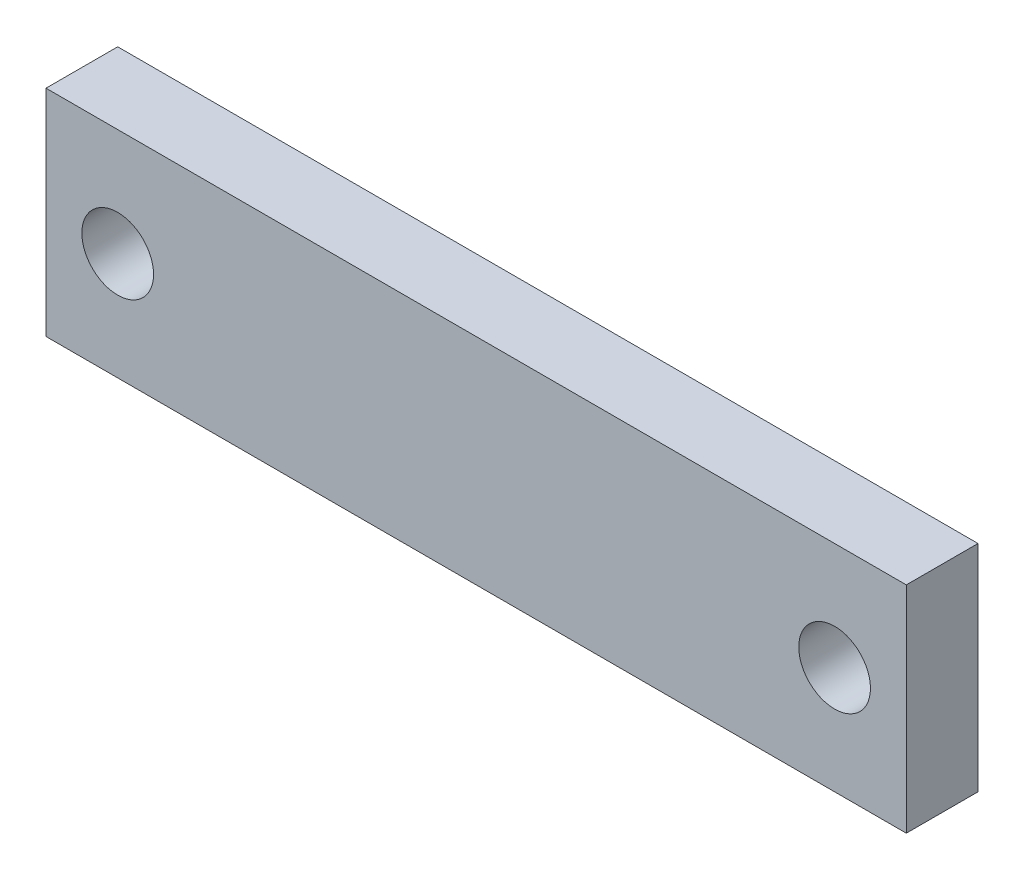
ISO-10303-21;
HEADER;
FILE_DESCRIPTION(('STEP AP214'),'2;1');
FILE_NAME('part.step','',(''),(''),'','','');
FILE_SCHEMA(('AUTOMOTIVE_DESIGN { 1 0 10303 214 1 1 1 1 }'));
ENDSEC;
DATA;
#1=APPLICATION_CONTEXT('core data for automotive mechanical design processes');
#2=APPLICATION_PROTOCOL_DEFINITION('international standard','automotive_design',2000,#1);
#3=PRODUCT_CONTEXT('',#1,'mechanical');
#4=PRODUCT('Part','Part','',(#3));
#5=PRODUCT_RELATED_PRODUCT_CATEGORY('part','',(#4));
#6=PRODUCT_DEFINITION_FORMATION('','',#4);
#7=PRODUCT_DEFINITION_CONTEXT('part definition',#1,'design');
#8=PRODUCT_DEFINITION('design','',#6,#7);
#9=PRODUCT_DEFINITION_SHAPE('','',#8);
#10=(LENGTH_UNIT() NAMED_UNIT(*) SI_UNIT(.MILLI.,.METRE.));
#11=(NAMED_UNIT(*) PLANE_ANGLE_UNIT() SI_UNIT($,.RADIAN.));
#12=(NAMED_UNIT(*) SI_UNIT($,.STERADIAN.) SOLID_ANGLE_UNIT());
#13=UNCERTAINTY_MEASURE_WITH_UNIT(LENGTH_MEASURE(1.E-05),#10,'distance_accuracy_value','');
#14=(GEOMETRIC_REPRESENTATION_CONTEXT(3) GLOBAL_UNCERTAINTY_ASSIGNED_CONTEXT((#13)) GLOBAL_UNIT_ASSIGNED_CONTEXT((#10,
#11,#12)) REPRESENTATION_CONTEXT('',''));
#15=CARTESIAN_POINT('',(0.,0.,0.));
#16=DIRECTION('',(0.,0.,1.));
#17=DIRECTION('',(1.,0.,0.));
#18=AXIS2_PLACEMENT_3D('',#15,#16,#17);
#19=CARTESIAN_POINT('',(-100.,0.,10.));
#20=DIRECTION('',(0.,0.,1.));
#21=DIRECTION('',(1.,0.,0.));
#22=AXIS2_PLACEMENT_3D('',#19,#20,#21);
#23=PLANE('',#22);
#24=CARTESIAN_POINT('',(-90.,15.,10.));
#25=DIRECTION('',(0.,0.,1.));
#26=DIRECTION('',(1.,0.,0.));
#27=AXIS2_PLACEMENT_3D('',#24,#25,#26);
#28=CIRCLE('',#27,5.);
#29=CARTESIAN_POINT('',(-85.,15.,10.));
#30=VERTEX_POINT('',#29);
#31=EDGE_CURVE('E97',#30,#30,#28,.T.);
#32=ORIENTED_EDGE('',*,*,#31,.F.);
#33=EDGE_LOOP('',(#32));
#34=FACE_BOUND('',#33,.T.);
#35=DIRECTION('',(0.,-1.,0.));
#36=VECTOR('',#35,1.);
#37=CARTESIAN_POINT('',(-100.,30.,10.));
#38=LINE('',#37,#36);
#39=CARTESIAN_POINT('',(-100.,30.,10.));
#40=VERTEX_POINT('',#39);
#41=CARTESIAN_POINT('',(-100.,0.,10.));
#42=VERTEX_POINT('',#41);
#43=EDGE_CURVE('E82',#40,#42,#38,.T.);
#44=ORIENTED_EDGE('',*,*,#43,.T.);
#45=DIRECTION('',(1.,0.,0.));
#46=VECTOR('',#45,1.);
#47=CARTESIAN_POINT('',(-100.,0.,10.));
#48=LINE('',#47,#46);
#49=CARTESIAN_POINT('',(20.,0.,10.));
#50=VERTEX_POINT('',#49);
#51=EDGE_CURVE('E77',#42,#50,#48,.T.);
#52=ORIENTED_EDGE('',*,*,#51,.T.);
#53=DIRECTION('',(0.,1.,0.));
#54=VECTOR('',#53,1.);
#55=CARTESIAN_POINT('',(20.,30.,10.));
#56=LINE('',#55,#54);
#57=CARTESIAN_POINT('',(20.,30.,10.));
#58=VERTEX_POINT('',#57);
#59=EDGE_CURVE('E80',#50,#58,#56,.T.);
#60=ORIENTED_EDGE('',*,*,#59,.T.);
#61=DIRECTION('',(-1.,0.,0.));
#62=VECTOR('',#61,1.);
#63=CARTESIAN_POINT('',(-100.,30.,10.));
#64=LINE('',#63,#62);
#65=EDGE_CURVE('E47',#58,#40,#64,.T.);
#66=ORIENTED_EDGE('',*,*,#65,.T.);
#67=EDGE_LOOP('',(#44,#52,#60,#66));
#68=FACE_BOUND('',#67,.T.);
#69=CARTESIAN_POINT('',(10.,15.,10.));
#70=DIRECTION('',(0.,0.,1.));
#71=DIRECTION('',(1.,0.,0.));
#72=AXIS2_PLACEMENT_3D('',#69,#70,#71);
#73=CIRCLE('',#72,4.99999999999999);
#74=CARTESIAN_POINT('',(15.,15.,10.));
#75=VERTEX_POINT('',#74);
#76=EDGE_CURVE('E112',#75,#75,#73,.T.);
#77=ORIENTED_EDGE('',*,*,#76,.F.);
#78=EDGE_LOOP('',(#77));
#79=FACE_BOUND('',#78,.T.);
#80=ADVANCED_FACE('F30',(#34,#68,#79),#23,.T.);
#81=CARTESIAN_POINT('',(-100.,0.,0.));
#82=DIRECTION('',(0.,0.,1.));
#83=DIRECTION('',(1.,0.,0.));
#84=AXIS2_PLACEMENT_3D('',#81,#82,#83);
#85=PLANE('',#84);
#86=CARTESIAN_POINT('',(-90.,15.,0.));
#87=DIRECTION('',(0.,0.,1.));
#88=DIRECTION('',(1.,0.,0.));
#89=AXIS2_PLACEMENT_3D('',#86,#87,#88);
#90=CIRCLE('',#89,5.);
#91=CARTESIAN_POINT('',(-85.,15.,0.));
#92=VERTEX_POINT('',#91);
#93=EDGE_CURVE('E109',#92,#92,#90,.T.);
#94=ORIENTED_EDGE('',*,*,#93,.T.);
#95=EDGE_LOOP('',(#94));
#96=FACE_BOUND('',#95,.T.);
#97=DIRECTION('',(0.,-1.,0.));
#98=VECTOR('',#97,1.);
#99=CARTESIAN_POINT('',(-100.,30.,0.));
#100=LINE('',#99,#98);
#101=CARTESIAN_POINT('',(-100.,30.,0.));
#102=VERTEX_POINT('',#101);
#103=CARTESIAN_POINT('',(-100.,0.,0.));
#104=VERTEX_POINT('',#103);
#105=EDGE_CURVE('E94',#102,#104,#100,.T.);
#106=ORIENTED_EDGE('',*,*,#105,.F.);
#107=DIRECTION('',(-1.,0.,0.));
#108=VECTOR('',#107,1.);
#109=CARTESIAN_POINT('',(-100.,30.,0.));
#110=LINE('',#109,#108);
#111=CARTESIAN_POINT('',(20.,30.,0.));
#112=VERTEX_POINT('',#111);
#113=EDGE_CURVE('E70',#112,#102,#110,.T.);
#114=ORIENTED_EDGE('',*,*,#113,.F.);
#115=DIRECTION('',(0.,1.,0.));
#116=VECTOR('',#115,1.);
#117=CARTESIAN_POINT('',(20.,30.,0.));
#118=LINE('',#117,#116);
#119=CARTESIAN_POINT('',(20.,0.,0.));
#120=VERTEX_POINT('',#119);
#121=EDGE_CURVE('E64',#120,#112,#118,.T.);
#122=ORIENTED_EDGE('',*,*,#121,.F.);
#123=DIRECTION('',(1.,0.,0.));
#124=VECTOR('',#123,1.);
#125=CARTESIAN_POINT('',(-100.,0.,0.));
#126=LINE('',#125,#124);
#127=EDGE_CURVE('E86',#104,#120,#126,.T.);
#128=ORIENTED_EDGE('',*,*,#127,.F.);
#129=EDGE_LOOP('',(#106,#114,#122,#128));
#130=FACE_BOUND('',#129,.T.);
#131=CARTESIAN_POINT('',(10.,15.,0.));
#132=DIRECTION('',(0.,0.,1.));
#133=DIRECTION('',(1.,0.,0.));
#134=AXIS2_PLACEMENT_3D('',#131,#132,#133);
#135=CIRCLE('',#134,4.99999999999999);
#136=CARTESIAN_POINT('',(15.,15.,0.));
#137=VERTEX_POINT('',#136);
#138=EDGE_CURVE('E115',#137,#137,#135,.T.);
#139=ORIENTED_EDGE('',*,*,#138,.T.);
#140=EDGE_LOOP('',(#139));
#141=FACE_BOUND('',#140,.T.);
#142=ADVANCED_FACE('F105',(#96,#130,#141),#85,.F.);
#143=CARTESIAN_POINT('',(-100.,30.,10.));
#144=DIRECTION('',(1.,0.,0.));
#145=DIRECTION('',(0.,0.,-1.));
#146=AXIS2_PLACEMENT_3D('',#143,#144,#145);
#147=PLANE('',#146);
#148=ORIENTED_EDGE('',*,*,#105,.T.);
#149=DIRECTION('',(0.,0.,-1.));
#150=VECTOR('',#149,1.);
#151=CARTESIAN_POINT('',(-100.,0.,10.));
#152=LINE('',#151,#150);
#153=EDGE_CURVE('E11',#42,#104,#152,.T.);
#154=ORIENTED_EDGE('',*,*,#153,.F.);
#155=ORIENTED_EDGE('',*,*,#43,.F.);
#156=DIRECTION('',(0.,0.,-1.));
#157=VECTOR('',#156,1.);
#158=CARTESIAN_POINT('',(-100.,30.,10.));
#159=LINE('',#158,#157);
#160=EDGE_CURVE('E90',#40,#102,#159,.T.);
#161=ORIENTED_EDGE('',*,*,#160,.T.);
#162=EDGE_LOOP('',(#148,#154,#155,#161));
#163=FACE_BOUND('',#162,.T.);
#164=ADVANCED_FACE('F32',(#163),#147,.F.);
#165=CARTESIAN_POINT('',(-100.,0.,10.));
#166=DIRECTION('',(0.,1.,0.));
#167=DIRECTION('',(0.,0.,1.));
#168=AXIS2_PLACEMENT_3D('',#165,#166,#167);
#169=PLANE('',#168);
#170=ORIENTED_EDGE('',*,*,#127,.T.);
#171=DIRECTION('',(0.,0.,-1.));
#172=VECTOR('',#171,1.);
#173=CARTESIAN_POINT('',(20.,0.,10.));
#174=LINE('',#173,#172);
#175=EDGE_CURVE('E39',#50,#120,#174,.T.);
#176=ORIENTED_EDGE('',*,*,#175,.F.);
#177=ORIENTED_EDGE('',*,*,#51,.F.);
#178=ORIENTED_EDGE('',*,*,#153,.T.);
#179=EDGE_LOOP('',(#170,#176,#177,#178));
#180=FACE_BOUND('',#179,.T.);
#181=ADVANCED_FACE('F85',(#180),#169,.F.);
#182=CARTESIAN_POINT('',(20.,30.,10.));
#183=DIRECTION('',(-1.,0.,0.));
#184=DIRECTION('',(0.,0.,1.));
#185=AXIS2_PLACEMENT_3D('',#182,#183,#184);
#186=PLANE('',#185);
#187=ORIENTED_EDGE('',*,*,#121,.T.);
#188=DIRECTION('',(0.,0.,-1.));
#189=VECTOR('',#188,1.);
#190=CARTESIAN_POINT('',(20.,30.,10.));
#191=LINE('',#190,#189);
#192=EDGE_CURVE('E87',#58,#112,#191,.T.);
#193=ORIENTED_EDGE('',*,*,#192,.F.);
#194=ORIENTED_EDGE('',*,*,#59,.F.);
#195=ORIENTED_EDGE('',*,*,#175,.T.);
#196=EDGE_LOOP('',(#187,#193,#194,#195));
#197=FACE_BOUND('',#196,.T.);
#198=ADVANCED_FACE('F88',(#197),#186,.F.);
#199=CARTESIAN_POINT('',(-100.,30.,10.));
#200=DIRECTION('',(0.,-1.,0.));
#201=DIRECTION('',(0.,0.,-1.));
#202=AXIS2_PLACEMENT_3D('',#199,#200,#201);
#203=PLANE('',#202);
#204=ORIENTED_EDGE('',*,*,#113,.T.);
#205=ORIENTED_EDGE('',*,*,#160,.F.);
#206=ORIENTED_EDGE('',*,*,#65,.F.);
#207=ORIENTED_EDGE('',*,*,#192,.T.);
#208=EDGE_LOOP('',(#204,#205,#206,#207));
#209=FACE_BOUND('',#208,.T.);
#210=ADVANCED_FACE('F102',(#209),#203,.F.);
#211=CARTESIAN_POINT('',(-90.,15.,10.));
#212=DIRECTION('',(0.,0.,-1.));
#213=DIRECTION('',(-1.,0.,0.));
#214=AXIS2_PLACEMENT_3D('',#211,#212,#213);
#215=CYLINDRICAL_SURFACE('',#214,5.);
#216=ORIENTED_EDGE('',*,*,#31,.T.);
#217=EDGE_LOOP('',(#216));
#218=FACE_BOUND('',#217,.T.);
#219=ORIENTED_EDGE('',*,*,#93,.F.);
#220=EDGE_LOOP('',(#219));
#221=FACE_BOUND('',#220,.T.);
#222=ADVANCED_FACE('F133',(#218,#221),#215,.F.);
#223=CARTESIAN_POINT('',(10.,15.,10.));
#224=DIRECTION('',(0.,0.,-1.));
#225=DIRECTION('',(-1.,0.,0.));
#226=AXIS2_PLACEMENT_3D('',#223,#224,#225);
#227=CYLINDRICAL_SURFACE('',#226,4.99999999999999);
#228=ORIENTED_EDGE('',*,*,#76,.T.);
#229=EDGE_LOOP('',(#228));
#230=FACE_BOUND('',#229,.T.);
#231=ORIENTED_EDGE('',*,*,#138,.F.);
#232=EDGE_LOOP('',(#231));
#233=FACE_BOUND('',#232,.T.);
#234=ADVANCED_FACE('F121',(#230,#233),#227,.F.);
#235=CLOSED_SHELL('',(#80,#142,#164,#181,#198,#210,#222,#234));
#236=MANIFOLD_SOLID_BREP('B2',#235);
#237=ADVANCED_BREP_SHAPE_REPRESENTATION('',(#18,#236),#14);
#238=SHAPE_DEFINITION_REPRESENTATION(#9,#237);
ENDSEC;
END-ISO-10303-21;
